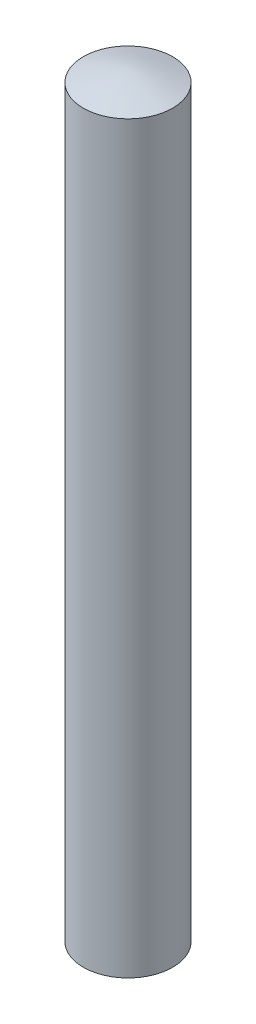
ISO-10303-21;
HEADER;
FILE_DESCRIPTION(('STEP AP214'),'2;1');
FILE_NAME('part.step','',(''),(''),'','','');
FILE_SCHEMA(('AUTOMOTIVE_DESIGN { 1 0 10303 214 1 1 1 1 }'));
ENDSEC;
DATA;
#1=APPLICATION_CONTEXT('core data for automotive mechanical design processes');
#2=APPLICATION_PROTOCOL_DEFINITION('international standard','automotive_design',2000,#1);
#3=PRODUCT_CONTEXT('',#1,'mechanical');
#4=PRODUCT('Part','Part','',(#3));
#5=PRODUCT_RELATED_PRODUCT_CATEGORY('part','',(#4));
#6=PRODUCT_DEFINITION_FORMATION('','',#4);
#7=PRODUCT_DEFINITION_CONTEXT('part definition',#1,'design');
#8=PRODUCT_DEFINITION('design','',#6,#7);
#9=PRODUCT_DEFINITION_SHAPE('','',#8);
#10=(LENGTH_UNIT() NAMED_UNIT(*) SI_UNIT(.MILLI.,.METRE.));
#11=(NAMED_UNIT(*) PLANE_ANGLE_UNIT() SI_UNIT($,.RADIAN.));
#12=(NAMED_UNIT(*) SI_UNIT($,.STERADIAN.) SOLID_ANGLE_UNIT());
#13=UNCERTAINTY_MEASURE_WITH_UNIT(LENGTH_MEASURE(1.E-05),#10,'distance_accuracy_value','');
#14=(GEOMETRIC_REPRESENTATION_CONTEXT(3) GLOBAL_UNCERTAINTY_ASSIGNED_CONTEXT((#13)) GLOBAL_UNIT_ASSIGNED_CONTEXT((#10,
#11,#12)) REPRESENTATION_CONTEXT('',''));
#15=CARTESIAN_POINT('',(0.,0.,0.));
#16=DIRECTION('',(0.,0.,1.));
#17=DIRECTION('',(1.,0.,0.));
#18=AXIS2_PLACEMENT_3D('',#15,#16,#17);
#19=CARTESIAN_POINT('',(-1.18779073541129,-0.154699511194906,-1.18738489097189));
#20=CARTESIAN_POINT('',(-0.997744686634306,-0.11912480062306,-1.18738489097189));
#21=CARTESIAN_POINT('',(-0.807698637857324,-0.08681403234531,-1.18738489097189));
#22=CARTESIAN_POINT('',(-0.617652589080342,-0.0569017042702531,-1.18738489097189));
#23=CARTESIAN_POINT('',(-0.332583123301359,-0.0224136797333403,-1.18738489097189));
#24=CARTESIAN_POINT('',(-0.0475136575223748,-0.0128617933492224,-1.18738489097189));
#25=CARTESIAN_POINT('',(0.0475097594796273,-0.012861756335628,-1.18738489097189));
#26=CARTESIAN_POINT('',(0.332580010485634,-0.0224134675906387,-1.18738489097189));
#27=CARTESIAN_POINT('',(0.61765026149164,-0.0569014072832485,-1.18738489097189));
#28=CARTESIAN_POINT('',(0.807697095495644,-0.0868136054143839,-1.18738489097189));
#29=CARTESIAN_POINT('',(0.997743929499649,-0.119124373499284,-1.18738489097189));
#30=CARTESIAN_POINT('',(1.18779076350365,-0.15469914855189,-1.18738489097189));
#31=CARTESIAN_POINT('',(-1.18779073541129,-0.118084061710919,-0.996600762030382));
#32=CARTESIAN_POINT('',(-0.997744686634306,-0.0767391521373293,-0.996600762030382));
#33=CARTESIAN_POINT('',(-0.807698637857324,-0.0386863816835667,-0.996600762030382));
#34=CARTESIAN_POINT('',(-0.617652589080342,-0.00274902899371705,-0.996600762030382));
#35=CARTESIAN_POINT('',(-0.332583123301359,0.0388790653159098,-0.996600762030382));
#36=CARTESIAN_POINT('',(-0.0475136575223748,0.0504310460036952,-0.996600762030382));
#37=CARTESIAN_POINT('',(0.0475097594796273,0.0504311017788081,-0.996600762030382));
#38=CARTESIAN_POINT('',(0.332580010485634,0.0388794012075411,-0.996600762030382));
#39=CARTESIAN_POINT('',(0.61765026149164,-0.00274856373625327,-0.996600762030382));
#40=CARTESIAN_POINT('',(0.807697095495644,-0.0386858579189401,-0.996600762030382));
#41=CARTESIAN_POINT('',(0.997743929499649,-0.0767387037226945,-0.996600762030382));
#42=CARTESIAN_POINT('',(1.18779076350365,-0.11808374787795,-0.996600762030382));
#43=CARTESIAN_POINT('',(-1.18779073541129,-0.0853544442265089,-0.805816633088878));
#44=CARTESIAN_POINT('',(-0.997744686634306,-0.0382887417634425,-0.805816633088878));
#45=CARTESIAN_POINT('',(-0.807698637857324,0.0053921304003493,-0.805816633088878));
#46=CARTESIAN_POINT('',(-0.617652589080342,0.0475489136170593,-0.805816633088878));
#47=CARTESIAN_POINT('',(-0.332583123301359,0.0965264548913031,-0.805816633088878));
#48=CARTESIAN_POINT('',(-0.0475136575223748,0.110145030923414,-0.805816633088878));
#49=CARTESIAN_POINT('',(0.0475097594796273,0.110145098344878,-0.805816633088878));
#50=CARTESIAN_POINT('',(0.332580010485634,0.0965269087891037,-0.805816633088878));
#51=CARTESIAN_POINT('',(0.61765026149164,0.0475495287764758,-0.805816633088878));
#52=CARTESIAN_POINT('',(0.807697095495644,0.00539269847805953,-0.805816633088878));
#53=CARTESIAN_POINT('',(0.997743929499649,-0.0382883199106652,-0.805816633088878));
#54=CARTESIAN_POINT('',(1.18779076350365,-0.085354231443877,-0.805816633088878));
#55=CARTESIAN_POINT('',(-1.18779073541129,-0.0555836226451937,-0.615032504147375));
#56=CARTESIAN_POINT('',(-0.997744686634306,-0.00263681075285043,-0.615032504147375));
#57=CARTESIAN_POINT('',(-0.807698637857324,0.0471934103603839,-0.615032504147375));
#58=CARTESIAN_POINT('',(-0.617652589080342,0.0962065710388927,-0.615032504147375));
#59=CARTESIAN_POINT('',(-0.332583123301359,0.152297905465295,-0.615032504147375));
#60=CARTESIAN_POINT('',(-0.0475136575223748,0.168059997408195,-0.615032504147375));
#61=CARTESIAN_POINT('',(0.0475097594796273,0.168060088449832,-0.615032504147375));
#62=CARTESIAN_POINT('',(0.332580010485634,0.152298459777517,-0.615032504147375));
#63=CARTESIAN_POINT('',(0.61765026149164,0.0962072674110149,-0.615032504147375));
#64=CARTESIAN_POINT('',(0.807697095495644,0.0471939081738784,-0.615032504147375));
#65=CARTESIAN_POINT('',(0.997743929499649,-0.00263653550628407,-0.615032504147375));
#66=CARTESIAN_POINT('',(1.18779076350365,-0.0555836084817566,-0.615032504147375));
#67=CARTESIAN_POINT('',(-1.18779073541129,-0.0215003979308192,-0.327709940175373));
#68=CARTESIAN_POINT('',(-0.997744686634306,0.0382736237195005,-0.327709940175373));
#69=CARTESIAN_POINT('',(-0.807698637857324,0.0952115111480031,-0.327709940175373));
#70=CARTESIAN_POINT('',(-0.617652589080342,0.151093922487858,-0.327709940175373));
#71=CARTESIAN_POINT('',(-0.332583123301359,0.220442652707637,-0.327709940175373));
#72=CARTESIAN_POINT('',(-0.0475136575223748,0.240295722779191,-0.327709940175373));
#73=CARTESIAN_POINT('',(0.0475097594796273,0.240295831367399,-0.327709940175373));
#74=CARTESIAN_POINT('',(0.332580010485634,0.220443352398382,-0.327709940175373));
#75=CARTESIAN_POINT('',(0.61765026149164,0.151094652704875,-0.327709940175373));
#76=CARTESIAN_POINT('',(0.807697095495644,0.0952119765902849,-0.327709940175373));
#77=CARTESIAN_POINT('',(0.997743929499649,0.0382738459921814,-0.327709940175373));
#78=CARTESIAN_POINT('',(1.18779076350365,-0.0215004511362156,-0.327709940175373));
#79=CARTESIAN_POINT('',(-1.18779073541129,-0.0124697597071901,-0.0403873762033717));
#80=CARTESIAN_POINT('',(-0.997744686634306,0.0489192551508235,-0.0403873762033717));
#81=CARTESIAN_POINT('',(-0.807698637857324,0.107553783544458,-0.0403873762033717));
#82=CARTESIAN_POINT('',(-0.617652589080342,0.165358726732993,-0.0403873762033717));
#83=CARTESIAN_POINT('',(-0.332583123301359,0.238342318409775,-0.0403873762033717));
#84=CARTESIAN_POINT('',(-0.0475136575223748,0.261104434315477,-0.0403873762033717));
#85=CARTESIAN_POINT('',(0.0475097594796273,0.261104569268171,-0.0403873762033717));
#86=CARTESIAN_POINT('',(0.332580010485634,0.238343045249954,-0.0403873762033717));
#87=CARTESIAN_POINT('',(0.61765026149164,0.165359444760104,-0.0403873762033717));
#88=CARTESIAN_POINT('',(0.807697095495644,0.107554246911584,-0.0403873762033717));
#89=CARTESIAN_POINT('',(0.997743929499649,0.0489194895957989,-0.0403873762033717));
#90=CARTESIAN_POINT('',(1.18779076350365,-0.0124697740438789,-0.0403873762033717));
#91=CARTESIAN_POINT('',(-1.18779073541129,-0.0126636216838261,0.0561510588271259));
#92=CARTESIAN_POINT('',(-0.997744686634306,0.0485909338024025,0.0561510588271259));
#93=CARTESIAN_POINT('',(-0.807698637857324,0.107103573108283,0.0561510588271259));
#94=CARTESIAN_POINT('',(-0.617652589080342,0.16481341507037,0.0561510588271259));
#95=CARTESIAN_POINT('',(-0.332583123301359,0.237631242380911,0.0561510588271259));
#96=CARTESIAN_POINT('',(-0.0475136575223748,0.260270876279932,0.0561510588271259));
#97=CARTESIAN_POINT('',(0.0475097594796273,0.260271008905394,0.0561510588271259));
#98=CARTESIAN_POINT('',(0.332580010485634,0.237631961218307,0.0561510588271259));
#99=CARTESIAN_POINT('',(0.61765026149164,0.164814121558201,0.0561510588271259));
#100=CARTESIAN_POINT('',(0.807697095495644,0.10710403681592,0.0561510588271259));
#101=CARTESIAN_POINT('',(0.997743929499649,0.0485911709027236,0.0561510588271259));
#102=CARTESIAN_POINT('',(1.18779076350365,-0.0126636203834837,0.0561510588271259));
#103=CARTESIAN_POINT('',(-1.18779073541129,-0.0228055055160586,0.345766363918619));
#104=CARTESIAN_POINT('',(-0.997744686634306,0.036018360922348,0.345766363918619));
#105=CARTESIAN_POINT('',(-0.807698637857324,0.092236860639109,0.345766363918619));
#106=CARTESIAN_POINT('',(-0.617652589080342,0.147252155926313,0.345766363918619));
#107=CARTESIAN_POINT('',(-0.332583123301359,0.215501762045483,0.345766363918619));
#108=CARTESIAN_POINT('',(-0.0475136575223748,0.234940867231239,0.345766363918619));
#109=CARTESIAN_POINT('',(0.0475097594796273,0.234940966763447,0.345766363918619));
#110=CARTESIAN_POINT('',(0.332580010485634,0.215502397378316,0.345766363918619));
#111=CARTESIAN_POINT('',(0.61765026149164,0.147252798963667,0.345766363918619));
#112=CARTESIAN_POINT('',(0.807697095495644,0.0922372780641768,0.345766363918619));
#113=CARTESIAN_POINT('',(0.997743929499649,0.0360186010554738,0.345766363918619));
#114=CARTESIAN_POINT('',(1.18779076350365,-0.0228054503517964,0.345766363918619));
#115=CARTESIAN_POINT('',(-1.18779073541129,-0.0575871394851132,0.635381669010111));
#116=CARTESIAN_POINT('',(-0.997744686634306,-0.0062891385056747,0.635381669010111));
#117=CARTESIAN_POINT('',(-0.807698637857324,0.0419683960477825,0.635381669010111));
#118=CARTESIAN_POINT('',(-0.617652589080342,0.089611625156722,0.635381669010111));
#119=CARTESIAN_POINT('',(-0.332583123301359,0.143962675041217,0.635381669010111));
#120=CARTESIAN_POINT('',(-0.0475136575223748,0.159285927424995,0.635381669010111));
#121=CARTESIAN_POINT('',(0.0475097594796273,0.15928601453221,0.635381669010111));
#122=CARTESIAN_POINT('',(0.332580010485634,0.143963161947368,0.635381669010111));
#123=CARTESIAN_POINT('',(0.61765026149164,0.0896120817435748,0.635381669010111));
#124=CARTESIAN_POINT('',(0.807697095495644,0.0419686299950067,0.635381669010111));
#125=CARTESIAN_POINT('',(0.997743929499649,-0.00628904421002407,0.635381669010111));
#126=CARTESIAN_POINT('',(1.18779076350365,-0.0575871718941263,0.635381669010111));
#127=CARTESIAN_POINT('',(-1.18779073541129,-0.0872981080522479,0.828458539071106));
#128=CARTESIAN_POINT('',(-0.997744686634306,-0.0422917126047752,0.828458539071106));
#129=CARTESIAN_POINT('',(-0.807698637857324,-0.000435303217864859,0.828458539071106));
#130=CARTESIAN_POINT('',(-0.617652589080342,0.0399417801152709,0.828458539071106));
#131=CARTESIAN_POINT('',(-0.332583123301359,0.0871035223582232,0.828458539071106));
#132=CARTESIAN_POINT('',(-0.0475136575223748,0.100182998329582,0.828458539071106));
#133=CARTESIAN_POINT('',(0.0475097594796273,0.100183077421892,0.828458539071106));
#134=CARTESIAN_POINT('',(0.332580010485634,0.0871040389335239,0.828458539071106));
#135=CARTESIAN_POINT('',(0.61765026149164,0.0399421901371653,0.828458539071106));
#136=CARTESIAN_POINT('',(0.807697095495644,-0.000435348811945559,0.828458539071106));
#137=CARTESIAN_POINT('',(0.997743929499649,-0.0422919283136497,0.828458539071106));
#138=CARTESIAN_POINT('',(1.18779076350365,-0.087298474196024,0.828458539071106));
#139=CARTESIAN_POINT('',(-1.18779073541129,-0.118748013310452,1.0215354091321));
#140=CARTESIAN_POINT('',(-0.997744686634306,-0.0797089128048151,1.0215354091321));
#141=CARTESIAN_POINT('',(-0.807698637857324,-0.043767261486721,1.0215354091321));
#142=CARTESIAN_POINT('',(-0.617652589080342,-0.00973776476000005,1.0215354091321));
#143=CARTESIAN_POINT('',(-0.332583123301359,0.0296817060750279,1.0215354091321));
#144=CARTESIAN_POINT('',(-0.0475136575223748,0.0405878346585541,1.0215354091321));
#145=CARTESIAN_POINT('',(0.0475097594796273,0.0405879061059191,1.0215354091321));
#146=CARTESIAN_POINT('',(0.332580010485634,0.0296821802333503,1.0215354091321));
#147=CARTESIAN_POINT('',(0.61765026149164,-0.00973725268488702,1.0215354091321));
#148=CARTESIAN_POINT('',(0.807697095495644,-0.0437673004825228,1.0215354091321));
#149=CARTESIAN_POINT('',(0.997743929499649,-0.0797092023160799,1.0215354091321));
#150=CARTESIAN_POINT('',(1.18779076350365,-0.118748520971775,1.0215354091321));
#151=CARTESIAN_POINT('',(-1.18779073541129,-0.152833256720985,1.2146122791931));
#152=CARTESIAN_POINT('',(-0.997744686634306,-0.119809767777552,1.2146122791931));
#153=CARTESIAN_POINT('',(-0.807698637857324,-0.0898280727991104,1.2146122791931));
#154=CARTESIAN_POINT('',(-0.617652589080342,-0.061948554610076,1.2146122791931));
#155=CARTESIAN_POINT('',(-0.332583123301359,-0.029899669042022,1.2146122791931));
#156=CARTESIAN_POINT('',(-0.0475136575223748,-0.0210659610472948,1.2146122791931));
#157=CARTESIAN_POINT('',(0.0475097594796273,-0.0210658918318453,1.2146122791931));
#158=CARTESIAN_POINT('',(0.332580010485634,-0.029899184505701,1.2146122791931));
#159=CARTESIAN_POINT('',(0.61765026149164,-0.0619479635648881,1.2146122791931));
#160=CARTESIAN_POINT('',(0.807697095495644,-0.0898280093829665,1.2146122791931));
#161=CARTESIAN_POINT('',(0.997743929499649,-0.119810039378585,1.2146122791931));
#162=CARTESIAN_POINT('',(1.18779076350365,-0.152833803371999,1.2146122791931));
#163=B_SPLINE_SURFACE_WITH_KNOTS('',5,5,((#19,#20,#21,#22,#23,#24,#25,#26,#27,#28,#29,#30),(#31,
#32,#33,#34,#35,#36,#37,#38,#39,#40,#41,#42),(#43,#44,#45,#46,#47,#48,#49,#50,#51,#52,#53,#54),
(#55,#56,#57,#58,#59,#60,#61,#62,#63,#64,#65,#66),(#67,#68,#69,#70,#71,#72,#73,#74,#75,#76,#77,
#78),(#79,#80,#81,#82,#83,#84,#85,#86,#87,#88,#89,#90),(#91,#92,#93,#94,#95,#96,#97,#98,#99,
#100,#101,#102),(#103,#104,#105,#106,#107,#108,#109,#110,#111,#112,#113,#114),(#115,#116,#117,
#118,#119,#120,#121,#122,#123,#124,#125,#126),(#127,#128,#129,#130,#131,#132,#133,#134,#135,
#136,#137,#138),(#139,#140,#141,#142,#143,#144,#145,#146,#147,#148,#149,#150),(#151,#152,#153,
#154,#155,#156,#157,#158,#159,#160,#161,#162)),.UNSPECIFIED.,.F.,.F.,.F.,(6,3,3,6),(6,3,3,6),
(-1.24181347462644,-0.287892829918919,0.194799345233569,1.16018369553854),(-1.18779073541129,
-0.237560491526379,0.237556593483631,1.18779076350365),.UNSPECIFIED.);
#164=CARTESIAN_POINT('',(2.06979073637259E-11,0.000144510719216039,-1.143));
#165=CARTESIAN_POINT('',(-0.0642027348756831,0.000144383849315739,-1.14299715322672));
#166=CARTESIAN_POINT('',(-0.12845201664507,0.000142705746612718,-1.13757241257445));
#167=CARTESIAN_POINT('',(-0.255181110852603,0.000123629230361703,-1.11600732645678));
#168=CARTESIAN_POINT('',(-0.317658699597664,0.000106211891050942,-1.09985408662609));
#169=CARTESIAN_POINT('',(-0.438990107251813,0.000131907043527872,-1.05729184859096));
#170=CARTESIAN_POINT('',(-0.497845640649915,0.000174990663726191,-1.03088774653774));
#171=CARTESIAN_POINT('',(-0.610271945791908,0.000274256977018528,-0.968580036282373));
#172=CARTESIAN_POINT('',(-0.663844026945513,0.000330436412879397,-0.932678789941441));
#173=CARTESIAN_POINT('',(-0.764207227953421,0.000396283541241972,-0.852388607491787));
#174=CARTESIAN_POINT('',(-0.810997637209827,0.000405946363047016,-0.807998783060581));
#175=CARTESIAN_POINT('',(-0.89646363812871,0.000369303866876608,-0.711992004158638));
#176=CARTESIAN_POINT('',(-0.935138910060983,0.000322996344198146,-0.66037476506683));
#177=CARTESIAN_POINT('',(-1.00327371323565,0.000219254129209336,-0.551381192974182));
#178=CARTESIAN_POINT('',(-1.03273347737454,0.00016181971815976,-0.494005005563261));
#179=CARTESIAN_POINT('',(-1.08160224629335,0.000111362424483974,-0.375121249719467));
#180=CARTESIAN_POINT('',(-1.10101127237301,0.000118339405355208,-0.313613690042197));
#181=CARTESIAN_POINT('',(-1.12922776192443,0.000143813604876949,-0.188212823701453));
#182=CARTESIAN_POINT('',(-1.13803517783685,0.000162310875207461,-0.124319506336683));
#183=CARTESIAN_POINT('',(-1.14479826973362,0.000184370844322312,0.00403879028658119));
#184=CARTESIAN_POINT('',(-1.14275396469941,0.000187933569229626,0.0685037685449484));
#185=CARTESIAN_POINT('',(-1.12787165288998,0.000168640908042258,0.196175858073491));
#186=CARTESIAN_POINT('',(-1.11503359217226,0.000145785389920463,0.259382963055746));
#187=CARTESIAN_POINT('',(-1.07892810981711,0.000123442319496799,0.38274478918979));
#188=CARTESIAN_POINT('',(-1.05566067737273,0.000123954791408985,0.442899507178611));
#189=CARTESIAN_POINT('',(-0.999356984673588,0.000161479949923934,0.558448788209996));
#190=CARTESIAN_POINT('',(-0.966320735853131,0.000198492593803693,0.613843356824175));
#191=CARTESIAN_POINT('',(-0.891417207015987,0.000254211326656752,0.7182999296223));
#192=CARTESIAN_POINT('',(-0.849549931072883,0.00027291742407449,0.767361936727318));
#193=CARTESIAN_POINT('',(-0.758172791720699,0.000272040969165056,0.857760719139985));
#194=CARTESIAN_POINT('',(-0.708662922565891,0.000252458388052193,0.899097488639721));
#195=CARTESIAN_POINT('',(-0.60340605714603,0.000193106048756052,0.97287232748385));
#196=CARTESIAN_POINT('',(-0.54765905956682,0.000153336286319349,1.00531039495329));
#197=CARTESIAN_POINT('',(-0.431510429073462,0.000107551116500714,1.06036700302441));
#198=CARTESIAN_POINT('',(-0.371108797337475,0.00010153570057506,1.08298554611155));
#199=CARTESIAN_POINT('',(-0.247365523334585,0.000105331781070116,1.11776103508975));
#200=CARTESIAN_POINT('',(-0.184023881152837,0.000115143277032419,1.12991798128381));
#201=CARTESIAN_POINT('',(-0.0561986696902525,0.000122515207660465,1.1434251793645));
#202=CARTESIAN_POINT('',(0.00828489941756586,0.000120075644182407,1.14477543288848));
#203=CARTESIAN_POINT('',(0.136563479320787,0.000115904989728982,1.13663092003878));
#204=CARTESIAN_POINT('',(0.200358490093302,0.000114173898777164,1.1271361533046));
#205=CARTESIAN_POINT('',(0.325449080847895,0.000105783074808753,1.09757110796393));
#206=CARTESIAN_POINT('',(0.386744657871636,9.91233359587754E-05,1.0775008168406));
#207=CARTESIAN_POINT('',(0.505096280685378,0.000129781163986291,1.02735446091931));
#208=CARTESIAN_POINT('',(0.562152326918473,0.000167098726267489,0.997278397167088));
#209=CARTESIAN_POINT('',(0.670405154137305,0.000232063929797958,0.9279743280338));
#210=CARTESIAN_POINT('',(0.721601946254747,0.000259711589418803,0.888746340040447));
#211=CARTESIAN_POINT('',(0.81668308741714,0.000277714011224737,0.802251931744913));
#212=CARTESIAN_POINT('',(0.86056743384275,0.000268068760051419,0.754985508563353));
#213=CARTESIAN_POINT('',(0.939777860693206,0.000222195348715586,0.6537560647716));
#214=CARTESIAN_POINT('',(0.975103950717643,0.000185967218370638,0.599793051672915));
#215=CARTESIAN_POINT('',(1.03619511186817,0.000134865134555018,0.486702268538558));
#216=CARTESIAN_POINT('',(1.06196019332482,0.000119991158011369,0.427574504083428));
#217=CARTESIAN_POINT('',(1.10319802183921,0.000131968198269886,0.305832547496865));
#218=CARTESIAN_POINT('',(1.11867075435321,0.000158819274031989,0.243218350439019));
#219=CARTESIAN_POINT('',(1.13888462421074,0.000185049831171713,0.116280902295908));
#220=CARTESIAN_POINT('',(1.14362574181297,0.000184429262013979,0.0519576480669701));
#221=CARTESIAN_POINT('',(1.14224173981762,0.000172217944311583,-0.0765717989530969));
#222=CARTESIAN_POINT('',(1.13611662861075,0.000160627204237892,-0.140777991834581));
#223=CARTESIAN_POINT('',(1.11317402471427,0.000128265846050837,-0.267250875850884));
#224=CARTESIAN_POINT('',(1.09635651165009,0.000107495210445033,-0.329517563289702));
#225=CARTESIAN_POINT('',(1.05250613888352,0.000133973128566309,-0.450344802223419));
#226=CARTESIAN_POINT('',(1.02547309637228,0.000181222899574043,-0.508905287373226));
#227=CARTESIAN_POINT('',(0.961960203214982,0.000283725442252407,-0.620654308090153));
#228=CARTESIAN_POINT('',(0.925480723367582,0.000338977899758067,-0.67384305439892));
#229=CARTESIAN_POINT('',(0.844114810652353,0.000399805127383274,-0.773336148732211));
#230=CARTESIAN_POINT('',(0.799229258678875,0.00040538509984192,-0.819641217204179));
#231=CARTESIAN_POINT('',(0.702308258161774,0.000362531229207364,-0.904070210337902));
#232=CARTESIAN_POINT('',(0.650271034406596,0.00031408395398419,-0.942192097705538));
#233=CARTESIAN_POINT('',(0.540515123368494,0.000211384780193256,-1.00917263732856));
#234=CARTESIAN_POINT('',(0.482793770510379,0.0001571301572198,-1.03802691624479));
#235=CARTESIAN_POINT('',(0.363371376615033,0.000109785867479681,-1.08560218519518));
#236=CARTESIAN_POINT('',(0.301675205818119,0.000116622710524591,-1.10433532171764));
#237=CARTESIAN_POINT('',(0.199654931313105,0.000130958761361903,-1.12614422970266));
#238=CARTESIAN_POINT('',(0.159993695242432,0.000137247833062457,-1.13245725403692));
#239=CARTESIAN_POINT('',(0.0802276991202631,0.000144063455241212,-1.14088602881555));
#240=CARTESIAN_POINT('',(0.0401229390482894,0.000144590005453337,-1.14300177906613));
#241=CARTESIAN_POINT('',(2.06979073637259E-11,0.000144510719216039,-1.143));
#242=B_SPLINE_CURVE_WITH_KNOTS('',3,(#164,#165,#166,#167,#168,#169,#170,#171,#172,#173,#174,
#175,#176,#177,#178,#179,#180,#181,#182,#183,#184,#185,#186,#187,#188,#189,#190,#191,#192,#193,
#194,#195,#196,#197,#198,#199,#200,#201,#202,#203,#204,#205,#206,#207,#208,#209,#210,#211,#212,
#213,#214,#215,#216,#217,#218,#219,#220,#221,#222,#223,#224,#225,#226,#227,#228,#229,#230,#231,
#232,#233,#234,#235,#236,#237,#238,#239,#240,#241),.UNSPECIFIED.,.T.,.F.,(4,2,2,2,2,2,2,2,2,2,2,
2,2,2,2,2,2,2,2,2,2,2,2,2,2,2,2,2,2,2,2,2,2,2,2,2,2,2,4),(0.,0.192461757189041,
0.385155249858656,0.577756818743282,0.770310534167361,0.962884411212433,1.15546587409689,
1.3480424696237,1.5406186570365,1.73319570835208,1.9257724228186,2.11835009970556,
2.31092797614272,2.50350562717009,2.69608318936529,2.88866089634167,3.08123864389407,
3.2738163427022,3.46639403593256,3.65897169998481,3.85154937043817,4.04412726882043,
4.23670514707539,4.4292826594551,4.62186024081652,4.81443760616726,5.00701476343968,
5.19959219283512,5.39216997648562,5.58474761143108,5.77732561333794,5.96990706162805,
6.16248095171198,6.35503467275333,6.5476362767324,6.74032863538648,6.9327892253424,
7.05306651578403,7.17334381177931),.UNSPECIFIED.);
#243=CARTESIAN_POINT('',(2.06979073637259E-11,0.000144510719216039,-1.143));
#244=VERTEX_POINT('',#243);
#245=EDGE_CURVE('E89',#244,#244,#242,.T.);
#246=ORIENTED_EDGE('',*,*,#245,.T.);
#247=EDGE_LOOP('',(#246));
#248=FACE_BOUND('',#247,.T.);
#249=ADVANCED_FACE('F83',(#248),#163,.T.);
#250=CARTESIAN_POINT('',(1.18779073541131,-18.8953004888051,-1.18738489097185));
#251=CARTESIAN_POINT('',(0.997744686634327,-18.9308751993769,-1.18738489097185));
#252=CARTESIAN_POINT('',(0.807698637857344,-18.9631859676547,-1.18738489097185));
#253=CARTESIAN_POINT('',(0.61765258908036,-18.9930982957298,-1.18738489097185));
#254=CARTESIAN_POINT('',(0.332583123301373,-19.0275863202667,-1.18738489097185));
#255=CARTESIAN_POINT('',(0.0475136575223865,-19.0371382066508,-1.18738489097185));
#256=CARTESIAN_POINT('',(-0.0475097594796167,-19.0371382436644,-1.18738489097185));
#257=CARTESIAN_POINT('',(-0.332580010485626,-19.0275865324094,-1.18738489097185));
#258=CARTESIAN_POINT('',(-0.617650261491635,-18.9930985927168,-1.18738489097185));
#259=CARTESIAN_POINT('',(-0.807697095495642,-18.9631863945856,-1.18738489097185));
#260=CARTESIAN_POINT('',(-0.997743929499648,-18.9308756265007,-1.18738489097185));
#261=CARTESIAN_POINT('',(-1.18779076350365,-18.8953008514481,-1.18738489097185));
#262=CARTESIAN_POINT('',(1.18779073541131,-18.931915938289,-0.996600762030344));
#263=CARTESIAN_POINT('',(0.997744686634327,-18.9732608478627,-0.996600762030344));
#264=CARTESIAN_POINT('',(0.807698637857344,-19.0113136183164,-0.996600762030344));
#265=CARTESIAN_POINT('',(0.61765258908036,-19.0472509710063,-0.996600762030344));
#266=CARTESIAN_POINT('',(0.332583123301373,-19.0888790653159,-0.996600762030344));
#267=CARTESIAN_POINT('',(0.0475136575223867,-19.1004310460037,-0.996600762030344));
#268=CARTESIAN_POINT('',(-0.0475097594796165,-19.1004311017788,-0.996600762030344));
#269=CARTESIAN_POINT('',(-0.332580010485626,-19.0888794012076,-0.996600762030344));
#270=CARTESIAN_POINT('',(-0.617650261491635,-19.0472514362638,-0.996600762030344));
#271=CARTESIAN_POINT('',(-0.807697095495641,-19.0113141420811,-0.996600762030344));
#272=CARTESIAN_POINT('',(-0.997743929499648,-18.9732612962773,-0.996600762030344));
#273=CARTESIAN_POINT('',(-1.18779076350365,-18.931916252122,-0.996600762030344));
#274=CARTESIAN_POINT('',(1.18779073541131,-18.9646455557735,-0.805816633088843));
#275=CARTESIAN_POINT('',(0.997744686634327,-19.0117112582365,-0.805816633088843));
#276=CARTESIAN_POINT('',(0.807698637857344,-19.0553921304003,-0.805816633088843));
#277=CARTESIAN_POINT('',(0.61765258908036,-19.0975489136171,-0.805816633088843));
#278=CARTESIAN_POINT('',(0.332583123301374,-19.1465264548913,-0.805816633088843));
#279=CARTESIAN_POINT('',(0.0475136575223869,-19.1601450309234,-0.805816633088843));
#280=CARTESIAN_POINT('',(-0.0475097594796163,-19.1601450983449,-0.805816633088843));
#281=CARTESIAN_POINT('',(-0.332580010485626,-19.1465269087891,-0.805816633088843));
#282=CARTESIAN_POINT('',(-0.617650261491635,-19.0975495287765,-0.805816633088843));
#283=CARTESIAN_POINT('',(-0.807697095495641,-19.0553926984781,-0.805816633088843));
#284=CARTESIAN_POINT('',(-0.997743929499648,-19.0117116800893,-0.805816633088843));
#285=CARTESIAN_POINT('',(-1.18779076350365,-18.9646457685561,-0.805816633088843));
#286=CARTESIAN_POINT('',(1.18779073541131,-18.9944163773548,-0.615032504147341));
#287=CARTESIAN_POINT('',(0.997744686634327,-19.0473631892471,-0.615032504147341));
#288=CARTESIAN_POINT('',(0.807698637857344,-19.0971934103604,-0.615032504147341));
#289=CARTESIAN_POINT('',(0.61765258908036,-19.1462065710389,-0.615032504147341));
#290=CARTESIAN_POINT('',(0.332583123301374,-19.2022979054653,-0.615032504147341));
#291=CARTESIAN_POINT('',(0.047513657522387,-19.2180599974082,-0.615032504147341));
#292=CARTESIAN_POINT('',(-0.0475097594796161,-19.2180600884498,-0.615032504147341));
#293=CARTESIAN_POINT('',(-0.332580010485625,-19.2022984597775,-0.615032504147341));
#294=CARTESIAN_POINT('',(-0.617650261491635,-19.146207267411,-0.615032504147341));
#295=CARTESIAN_POINT('',(-0.807697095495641,-19.0971939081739,-0.615032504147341));
#296=CARTESIAN_POINT('',(-0.997743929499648,-19.0473634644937,-0.615032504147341));
#297=CARTESIAN_POINT('',(-1.18779076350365,-18.9944163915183,-0.615032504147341));
#298=CARTESIAN_POINT('',(1.18779073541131,-19.0284996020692,-0.327709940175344));
#299=CARTESIAN_POINT('',(0.997744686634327,-19.0882736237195,-0.327709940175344));
#300=CARTESIAN_POINT('',(0.807698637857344,-19.145211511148,-0.327709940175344));
#301=CARTESIAN_POINT('',(0.61765258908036,-19.2010939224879,-0.327709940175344));
#302=CARTESIAN_POINT('',(0.332583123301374,-19.2704426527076,-0.327709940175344));
#303=CARTESIAN_POINT('',(0.0475136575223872,-19.2902957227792,-0.327709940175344));
#304=CARTESIAN_POINT('',(-0.0475097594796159,-19.2902958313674,-0.327709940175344));
#305=CARTESIAN_POINT('',(-0.332580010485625,-19.2704433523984,-0.327709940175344));
#306=CARTESIAN_POINT('',(-0.617650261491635,-19.2010946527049,-0.327709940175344));
#307=CARTESIAN_POINT('',(-0.807697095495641,-19.1452119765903,-0.327709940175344));
#308=CARTESIAN_POINT('',(-0.997743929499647,-19.0882738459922,-0.327709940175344));
#309=CARTESIAN_POINT('',(-1.18779076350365,-19.0284995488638,-0.327709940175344));
#310=CARTESIAN_POINT('',(1.18779073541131,-19.0375302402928,-0.0403873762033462));
#311=CARTESIAN_POINT('',(0.997744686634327,-19.0989192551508,-0.0403873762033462));
#312=CARTESIAN_POINT('',(0.807698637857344,-19.1575537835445,-0.0403873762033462));
#313=CARTESIAN_POINT('',(0.61765258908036,-19.215358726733,-0.0403873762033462));
#314=CARTESIAN_POINT('',(0.332583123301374,-19.2883423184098,-0.0403873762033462));
#315=CARTESIAN_POINT('',(0.0475136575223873,-19.3111044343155,-0.0403873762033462));
#316=CARTESIAN_POINT('',(-0.0475097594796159,-19.3111045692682,-0.0403873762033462));
#317=CARTESIAN_POINT('',(-0.332580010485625,-19.28834304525,-0.0403873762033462));
#318=CARTESIAN_POINT('',(-0.617650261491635,-19.2153594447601,-0.0403873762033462));
#319=CARTESIAN_POINT('',(-0.807697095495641,-19.1575542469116,-0.0403873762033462));
#320=CARTESIAN_POINT('',(-0.997743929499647,-19.0989194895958,-0.0403873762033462));
#321=CARTESIAN_POINT('',(-1.18779076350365,-19.0375302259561,-0.0403873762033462));
#322=CARTESIAN_POINT('',(1.18779073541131,-19.0373363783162,0.05615105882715));
#323=CARTESIAN_POINT('',(0.997744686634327,-19.0985909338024,0.05615105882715));
#324=CARTESIAN_POINT('',(0.807698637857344,-19.1571035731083,0.05615105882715));
#325=CARTESIAN_POINT('',(0.61765258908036,-19.2148134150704,0.05615105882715));
#326=CARTESIAN_POINT('',(0.332583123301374,-19.2876312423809,0.05615105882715));
#327=CARTESIAN_POINT('',(0.0475136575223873,-19.3102708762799,0.05615105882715));
#328=CARTESIAN_POINT('',(-0.0475097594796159,-19.3102710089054,0.05615105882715));
#329=CARTESIAN_POINT('',(-0.332580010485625,-19.2876319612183,0.05615105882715));
#330=CARTESIAN_POINT('',(-0.617650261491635,-19.2148141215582,0.05615105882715));
#331=CARTESIAN_POINT('',(-0.807697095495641,-19.1571040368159,0.05615105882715));
#332=CARTESIAN_POINT('',(-0.997743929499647,-19.0985911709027,0.05615105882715));
#333=CARTESIAN_POINT('',(-1.18779076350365,-19.0373363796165,0.05615105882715));
#334=CARTESIAN_POINT('',(1.18779073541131,-19.0271944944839,0.345766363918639));
#335=CARTESIAN_POINT('',(0.997744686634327,-19.0860183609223,0.345766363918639));
#336=CARTESIAN_POINT('',(0.807698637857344,-19.1422368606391,0.345766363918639));
#337=CARTESIAN_POINT('',(0.61765258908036,-19.1972521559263,0.345766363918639));
#338=CARTESIAN_POINT('',(0.332583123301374,-19.2655017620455,0.345766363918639));
#339=CARTESIAN_POINT('',(0.0475136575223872,-19.2849408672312,0.345766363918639));
#340=CARTESIAN_POINT('',(-0.0475097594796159,-19.2849409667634,0.345766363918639));
#341=CARTESIAN_POINT('',(-0.332580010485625,-19.2655023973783,0.345766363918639));
#342=CARTESIAN_POINT('',(-0.617650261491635,-19.1972527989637,0.345766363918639));
#343=CARTESIAN_POINT('',(-0.807697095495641,-19.1422372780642,0.345766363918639));
#344=CARTESIAN_POINT('',(-0.997743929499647,-19.0860186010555,0.345766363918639));
#345=CARTESIAN_POINT('',(-1.18779076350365,-19.0271945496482,0.345766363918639));
#346=CARTESIAN_POINT('',(1.18779073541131,-18.9924128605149,0.635381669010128));
#347=CARTESIAN_POINT('',(0.997744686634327,-19.0437108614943,0.635381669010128));
#348=CARTESIAN_POINT('',(0.807698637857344,-19.0919683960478,0.635381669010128));
#349=CARTESIAN_POINT('',(0.61765258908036,-19.1396116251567,0.635381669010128));
#350=CARTESIAN_POINT('',(0.332583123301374,-19.1939626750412,0.635381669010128));
#351=CARTESIAN_POINT('',(0.047513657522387,-19.209285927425,0.635381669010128));
#352=CARTESIAN_POINT('',(-0.0475097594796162,-19.2092860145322,0.635381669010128));
#353=CARTESIAN_POINT('',(-0.332580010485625,-19.1939631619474,0.635381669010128));
#354=CARTESIAN_POINT('',(-0.617650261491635,-19.1396120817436,0.635381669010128));
#355=CARTESIAN_POINT('',(-0.807697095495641,-19.091968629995,0.635381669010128));
#356=CARTESIAN_POINT('',(-0.997743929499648,-19.04371095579,0.635381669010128));
#357=CARTESIAN_POINT('',(-1.18779076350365,-18.9924128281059,0.635381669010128));
#358=CARTESIAN_POINT('',(1.18779073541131,-18.9627018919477,0.82845853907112));
#359=CARTESIAN_POINT('',(0.997744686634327,-19.0077082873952,0.82845853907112));
#360=CARTESIAN_POINT('',(0.807698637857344,-19.0495646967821,0.82845853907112));
#361=CARTESIAN_POINT('',(0.61765258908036,-19.0899417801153,0.82845853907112));
#362=CARTESIAN_POINT('',(0.332583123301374,-19.1371035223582,0.82845853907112));
#363=CARTESIAN_POINT('',(0.0475136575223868,-19.1501829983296,0.82845853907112));
#364=CARTESIAN_POINT('',(-0.0475097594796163,-19.1501830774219,0.82845853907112));
#365=CARTESIAN_POINT('',(-0.332580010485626,-19.1371040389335,0.82845853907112));
#366=CARTESIAN_POINT('',(-0.617650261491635,-19.0899421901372,0.82845853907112));
#367=CARTESIAN_POINT('',(-0.807697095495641,-19.0495646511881,0.82845853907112));
#368=CARTESIAN_POINT('',(-0.997743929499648,-19.0077080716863,0.82845853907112));
#369=CARTESIAN_POINT('',(-1.18779076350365,-18.962701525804,0.82845853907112));
#370=CARTESIAN_POINT('',(1.18779073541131,-18.9312519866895,1.02153540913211));
#371=CARTESIAN_POINT('',(0.997744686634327,-18.9702910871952,1.02153540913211));
#372=CARTESIAN_POINT('',(0.807698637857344,-19.0062327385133,1.02153540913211));
#373=CARTESIAN_POINT('',(0.61765258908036,-19.04026223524,1.02153540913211));
#374=CARTESIAN_POINT('',(0.332583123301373,-19.079681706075,1.02153540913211));
#375=CARTESIAN_POINT('',(0.0475136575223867,-19.0905878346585,1.02153540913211));
#376=CARTESIAN_POINT('',(-0.0475097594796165,-19.0905879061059,1.02153540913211));
#377=CARTESIAN_POINT('',(-0.332580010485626,-19.0796821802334,1.02153540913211));
#378=CARTESIAN_POINT('',(-0.617650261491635,-19.0402627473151,1.02153540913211));
#379=CARTESIAN_POINT('',(-0.807697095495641,-19.0062326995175,1.02153540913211));
#380=CARTESIAN_POINT('',(-0.997743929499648,-18.9702907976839,1.02153540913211));
#381=CARTESIAN_POINT('',(-1.18779076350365,-18.9312514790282,1.02153540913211));
#382=CARTESIAN_POINT('',(1.18779073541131,-18.897166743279,1.21461227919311));
#383=CARTESIAN_POINT('',(0.997744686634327,-18.9301902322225,1.21461227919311));
#384=CARTESIAN_POINT('',(0.807698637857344,-18.9601719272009,1.21461227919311));
#385=CARTESIAN_POINT('',(0.61765258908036,-18.9880514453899,1.21461227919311));
#386=CARTESIAN_POINT('',(0.332583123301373,-19.020100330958,1.21461227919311));
#387=CARTESIAN_POINT('',(0.0475136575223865,-19.0289340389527,1.21461227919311));
#388=CARTESIAN_POINT('',(-0.0475097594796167,-19.0289341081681,1.21461227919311));
#389=CARTESIAN_POINT('',(-0.332580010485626,-19.0201008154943,1.21461227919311));
#390=CARTESIAN_POINT('',(-0.617650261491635,-18.9880520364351,1.21461227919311));
#391=CARTESIAN_POINT('',(-0.807697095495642,-18.960171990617,1.21461227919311));
#392=CARTESIAN_POINT('',(-0.997743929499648,-18.9301899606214,1.21461227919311));
#393=CARTESIAN_POINT('',(-1.18779076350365,-18.897166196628,1.21461227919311));
#394=B_SPLINE_SURFACE_WITH_KNOTS('',5,5,((#250,#251,#252,#253,#254,#255,#256,#257,#258,#259,
#260,#261),(#262,#263,#264,#265,#266,#267,#268,#269,#270,#271,#272,#273),(#274,#275,#276,#277,
#278,#279,#280,#281,#282,#283,#284,#285),(#286,#287,#288,#289,#290,#291,#292,#293,#294,#295,
#296,#297),(#298,#299,#300,#301,#302,#303,#304,#305,#306,#307,#308,#309),(#310,#311,#312,#313,
#314,#315,#316,#317,#318,#319,#320,#321),(#322,#323,#324,#325,#326,#327,#328,#329,#330,#331,
#332,#333),(#334,#335,#336,#337,#338,#339,#340,#341,#342,#343,#344,#345),(#346,#347,#348,#349,
#350,#351,#352,#353,#354,#355,#356,#357),(#358,#359,#360,#361,#362,#363,#364,#365,#366,#367,
#368,#369),(#370,#371,#372,#373,#374,#375,#376,#377,#378,#379,#380,#381),(#382,#383,#384,#385,
#386,#387,#388,#389,#390,#391,#392,#393)),.UNSPECIFIED.,.F.,.F.,.F.,(6,3,3,6),(6,3,3,6),
(-1.2418134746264,-0.287892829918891,0.19479934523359,1.16018369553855),(-1.18779073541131,
-0.237560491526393,0.237556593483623,1.18779076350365),.UNSPECIFIED.);
#395=CARTESIAN_POINT('',(-2.06975177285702E-11,-19.0501445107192,-1.143));
#396=CARTESIAN_POINT('',(-0.064202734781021,-19.0501443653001,-1.14299715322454));
#397=CARTESIAN_POINT('',(-0.128452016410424,-19.0501426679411,-1.13757241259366));
#398=CARTESIAN_POINT('',(-0.255181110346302,-19.0501235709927,-1.1160073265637));
#399=CARTESIAN_POINT('',(-0.317658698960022,-19.0501061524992,-1.09985408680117));
#400=CARTESIAN_POINT('',(-0.438990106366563,-19.050131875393,-1.05729184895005));
#401=CARTESIAN_POINT('',(-0.497845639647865,-19.0501749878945,-1.03088774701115));
#402=CARTESIAN_POINT('',(-0.610271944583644,-19.0502743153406,-0.968580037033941));
#403=CARTESIAN_POINT('',(-0.663844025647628,-19.050330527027,-0.932678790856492));
#404=CARTESIAN_POINT('',(-0.764207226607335,-19.0503964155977,-0.85238860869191));
#405=CARTESIAN_POINT('',(-0.810997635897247,-19.0504060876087,-0.807998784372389));
#406=CARTESIAN_POINT('',(-0.896463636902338,-19.0503694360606,-0.711992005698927));
#407=CARTESIAN_POINT('',(-0.935138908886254,-19.0503231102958,-0.660374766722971));
#408=CARTESIAN_POINT('',(-1.00327371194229,-19.0502193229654,-0.551381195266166));
#409=CARTESIAN_POINT('',(-1.03273347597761,-19.0501618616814,-0.494005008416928));
#410=CARTESIAN_POINT('',(-1.08160224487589,-19.0501113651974,-0.375121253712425));
#411=CARTESIAN_POINT('',(-1.10101127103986,-19.0501183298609,-0.313613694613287));
#412=CARTESIAN_POINT('',(-1.12922776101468,-19.0501437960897,-0.188212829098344));
#413=CARTESIAN_POINT('',(-1.13803517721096,-19.0501622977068,-0.124319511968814));
#414=CARTESIAN_POINT('',(-1.14479826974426,-19.0501843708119,0.0040387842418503));
#415=CARTESIAN_POINT('',(-1.14275396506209,-19.0501879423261,0.0685037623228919));
#416=CARTESIAN_POINT('',(-1.12787165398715,-19.0501686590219,0.196175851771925));
#417=CARTESIAN_POINT('',(-1.11503359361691,-19.0501458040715,0.25938295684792));
#418=CARTESIAN_POINT('',(-1.07892811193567,-19.0501234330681,0.38274478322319));
#419=CARTESIAN_POINT('',(-1.05566067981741,-19.0501239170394,0.442899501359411));
#420=CARTESIAN_POINT('',(-0.999356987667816,-19.0501613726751,0.5584487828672));
#421=CARTESIAN_POINT('',(-0.966320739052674,-19.050198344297,0.613843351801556));
#422=CARTESIAN_POINT('',(-0.891417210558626,-19.0502540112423,0.718299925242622));
#423=CARTESIAN_POINT('',(-0.849549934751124,-19.0502727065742,0.767361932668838));
#424=CARTESIAN_POINT('',(-0.758172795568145,-19.0502718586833,0.857760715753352));
#425=CARTESIAN_POINT('',(-0.708662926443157,-19.0502523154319,0.899097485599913));
#426=CARTESIAN_POINT('',(-0.603406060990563,-19.0501930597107,0.972872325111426));
#427=CARTESIAN_POINT('',(-0.547659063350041,-19.0501533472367,1.0053103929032));
#428=CARTESIAN_POINT('',(-0.431510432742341,-19.0501076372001,1.06036700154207));
#429=CARTESIAN_POINT('',(-0.371108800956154,-19.050101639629,1.0829855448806));
#430=CARTESIAN_POINT('',(-0.247365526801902,-19.0501054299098,1.11776103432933));
#431=CARTESIAN_POINT('',(-0.184023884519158,-19.0501152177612,1.12991798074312));
#432=CARTESIAN_POINT('',(-0.0561986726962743,-19.0501225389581,1.14342517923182));
#433=CARTESIAN_POINT('',(0.00828489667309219,-19.0501200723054,1.14477543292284));
#434=CARTESIAN_POINT('',(0.136563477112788,-19.0501158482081,1.13663092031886));
#435=CARTESIAN_POINT('',(0.200358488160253,-19.0501140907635,1.12713615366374));
#436=CARTESIAN_POINT('',(0.325449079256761,-19.0501056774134,1.09757110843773));
#437=CARTESIAN_POINT('',(0.386744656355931,-19.0500990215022,1.07750081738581));
#438=CARTESIAN_POINT('',(0.505096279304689,-19.0501297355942,1.02735446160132));
#439=CARTESIAN_POINT('',(0.562152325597,-19.0501671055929,0.997278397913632));
#440=CARTESIAN_POINT('',(0.670405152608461,-19.0502321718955,0.927974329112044));
#441=CARTESIAN_POINT('',(0.721601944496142,-19.0502598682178,0.888746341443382));
#442=CARTESIAN_POINT('',(0.816683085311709,-19.0502779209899,0.802251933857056));
#443=CARTESIAN_POINT('',(0.860567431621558,-19.0502682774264,0.754985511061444));
#444=CARTESIAN_POINT('',(0.939777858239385,-19.0502223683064,0.653756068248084));
#445=CARTESIAN_POINT('',(0.975103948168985,-19.0501861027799,0.599793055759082));
#446=CARTESIAN_POINT('',(1.03619510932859,-19.0501349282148,0.486702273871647));
#447=CARTESIAN_POINT('',(1.0619601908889,-19.0501200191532,0.427574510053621));
#448=CARTESIAN_POINT('',(1.10319801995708,-19.0501319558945,0.305832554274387));
#449=CARTESIAN_POINT('',(1.11867075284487,-19.0501588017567,0.243218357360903));
#450=CARTESIAN_POINT('',(1.1388846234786,-19.0501850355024,0.116280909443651));
#451=CARTESIAN_POINT('',(1.14362574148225,-19.0501844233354,0.051957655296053));
#452=CARTESIAN_POINT('',(1.14224174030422,-19.0501722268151,-0.0765717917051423));
#453=CARTESIAN_POINT('',(1.13611662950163,-19.0501606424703,-0.140777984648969));
#454=CARTESIAN_POINT('',(1.11317402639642,-19.0501282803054,-0.267250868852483));
#455=CARTESIAN_POINT('',(1.09635651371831,-19.0501075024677,-0.329517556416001));
#456=CARTESIAN_POINT('',(1.05250614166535,-19.0501339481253,-0.450344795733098));
#457=CARTESIAN_POINT('',(1.02547309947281,-19.0501811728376,-0.508905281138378));
#458=CARTESIAN_POINT('',(0.961960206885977,-19.050283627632,-0.620654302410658));
#459=CARTESIAN_POINT('',(0.925480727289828,-19.0503388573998,-0.673843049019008));
#460=CARTESIAN_POINT('',(0.844114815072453,-19.0503996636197,-0.773336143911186));
#461=CARTESIAN_POINT('',(0.799229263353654,-19.0504052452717,-0.819641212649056));
#462=CARTESIAN_POINT('',(0.702308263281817,-19.0503624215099,-0.904070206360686));
#463=CARTESIAN_POINT('',(0.650271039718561,-19.0503140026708,-0.942192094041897));
#464=CARTESIAN_POINT('',(0.540515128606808,-19.0502113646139,-1.00917263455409));
#465=CARTESIAN_POINT('',(0.482793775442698,-19.0501571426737,-1.03802691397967));
#466=CARTESIAN_POINT('',(0.363371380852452,-19.0501098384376,-1.0856021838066));
#467=CARTESIAN_POINT('',(0.301675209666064,-19.0501166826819,-1.1043353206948));
#468=CARTESIAN_POINT('',(0.199654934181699,-19.0501310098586,-1.12614422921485));
#469=CARTESIAN_POINT('',(0.159993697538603,-19.0501372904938,-1.13245725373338));
#470=CARTESIAN_POINT('',(0.0802277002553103,-19.0501440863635,-1.14088602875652));
#471=CARTESIAN_POINT('',(0.0401229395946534,-19.0501446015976,-1.14300177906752));
#472=CARTESIAN_POINT('',(-2.06975177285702E-11,-19.0501445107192,-1.143));
#473=B_SPLINE_CURVE_WITH_KNOTS('',3,(#395,#396,#397,#398,#399,#400,#401,#402,#403,#404,#405,
#406,#407,#408,#409,#410,#411,#412,#413,#414,#415,#416,#417,#418,#419,#420,#421,#422,#423,#424,
#425,#426,#427,#428,#429,#430,#431,#432,#433,#434,#435,#436,#437,#438,#439,#440,#441,#442,#443,
#444,#445,#446,#447,#448,#449,#450,#451,#452,#453,#454,#455,#456,#457,#458,#459,#460,#461,#462,
#463,#464,#465,#466,#467,#468,#469,#470,#471,#472),.UNSPECIFIED.,.T.,.F.,(4,2,2,2,2,2,2,2,2,2,2,
2,2,2,2,2,2,2,2,2,2,2,2,2,2,2,2,2,2,2,2,2,2,2,2,2,2,2,4),(0.,0.192461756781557,
0.385155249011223,0.577756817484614,0.770310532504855,0.962884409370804,1.15546587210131,
1.34804246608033,1.54061865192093,1.73319570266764,1.92577241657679,2.11835009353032,
2.31092797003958,2.50350562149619,2.69608318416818,2.88866089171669,3.08123863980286,
3.27381633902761,3.46639403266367,3.65897169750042,3.85154936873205,4.04412726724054,
4.2367051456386,4.4292826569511,4.62186023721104,4.8144376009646,5.00701475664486,
5.19959218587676,5.39216996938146,5.58474760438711,5.7773256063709,5.96990705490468,
6.1624809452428,6.35503466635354,6.54763627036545,6.74032863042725,6.93278922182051,
7.05306651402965,7.17334381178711),.UNSPECIFIED.);
#474=CARTESIAN_POINT('',(-2.06975177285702E-11,-19.0501445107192,-1.143));
#475=VERTEX_POINT('',#474);
#476=EDGE_CURVE('E12',#475,#475,#473,.T.);
#477=ORIENTED_EDGE('',*,*,#476,.F.);
#478=EDGE_LOOP('',(#477));
#479=FACE_BOUND('',#478,.T.);
#480=ADVANCED_FACE('F105',(#479),#394,.T.);
#481=CARTESIAN_POINT('',(0.,0.,0.));
#482=DIRECTION('',(0.,1.,0.));
#483=DIRECTION('',(0.,0.,1.));
#484=AXIS2_PLACEMENT_3D('',#481,#482,#483);
#485=CYLINDRICAL_SURFACE('',#484,1.143);
#486=ORIENTED_EDGE('',*,*,#476,.T.);
#487=EDGE_LOOP('',(#486));
#488=FACE_BOUND('',#487,.T.);
#489=ORIENTED_EDGE('',*,*,#245,.F.);
#490=EDGE_LOOP('',(#489));
#491=FACE_BOUND('',#490,.T.);
#492=ADVANCED_FACE('F103',(#488,#491),#485,.T.);
#493=CLOSED_SHELL('',(#249,#480,#492));
#494=MANIFOLD_SOLID_BREP('B2',#493);
#495=ADVANCED_BREP_SHAPE_REPRESENTATION('',(#18,#494),#14);
#496=SHAPE_DEFINITION_REPRESENTATION(#9,#495);
ENDSEC;
END-ISO-10303-21;
